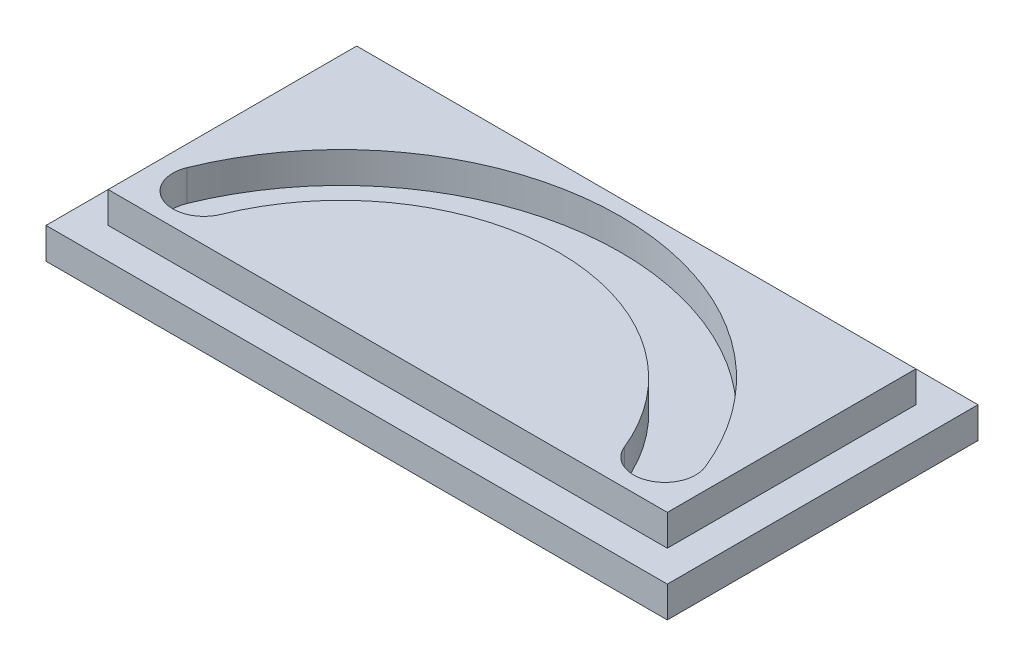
from build123d import *

# Parameters (mm, degrees)
SKETCH1_W           = 200
SKETCH1_H           = 100
SKETCH1_W_2         = 180
SKETCH1_H_2         = 80
BOSS_EXTRUDE1_DEPTH = 10
SKETCH1_3_W         = 180
SKETCH1_3_H         = 80
BOSS_EXTRUDE2_DEPTH = 20
CUT_EXTRUDE1_DEPTH  = 10


with BuildPart() as part:
    # Sketch1 → Boss-Extrude1 (new body)
    # profile 1 of 2: a face of its own
    with BuildSketch(Plane(origin=(0, 0, 0), x_dir=(1, 0, 0), z_dir=(0, 1, 0))):
        Rectangle(SKETCH1_W, SKETCH1_H)
        Rectangle(SKETCH1_W_2, SKETCH1_H_2, mode=Mode.SUBTRACT)
    # profile 2 of 2: a face of its own
    with BuildSketch(Plane(origin=(0, 0, 0), x_dir=(1, 0, 0), z_dir=(0, 1, 0))):
        Rectangle(SKETCH1_W_2, SKETCH1_H_2)
    extrude(amount=BOSS_EXTRUDE1_DEPTH)

    # Sketch1_3 → Boss-Extrude2 (add)
    with BuildSketch(Plane(origin=(0, 0, 0), x_dir=(1, 0, 0), z_dir=(0, 1, 0))):
        Rectangle(SKETCH1_3_W, SKETCH1_3_H)
    extrude(amount=BOSS_EXTRUDE2_DEPTH)

    # Sketch2 → Cut-Extrude1 (cut)
    with BuildSketch(Plane(origin=(0, 20, 0), x_dir=(1, 0, 0), z_dir=(0, 1, 0))):
        with BuildLine():
            ThreePointArc((83.43223298, -21.25), (0, 35), (-83.43223298, -21.25))
            ThreePointArc((-83.43223298, -21.25), (-77.911984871, -34.270248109), (-64.891736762, -28.75))
            ThreePointArc((-64.891736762, -28.75), (0, 15), (64.891736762, -28.75))
            ThreePointArc((64.891736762, -28.75), (77.911984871, -34.270248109), (83.43223298, -21.25))
        make_face()
    extrude(amount=-CUT_EXTRUDE1_DEPTH, mode=Mode.SUBTRACT)


solid = part.part
